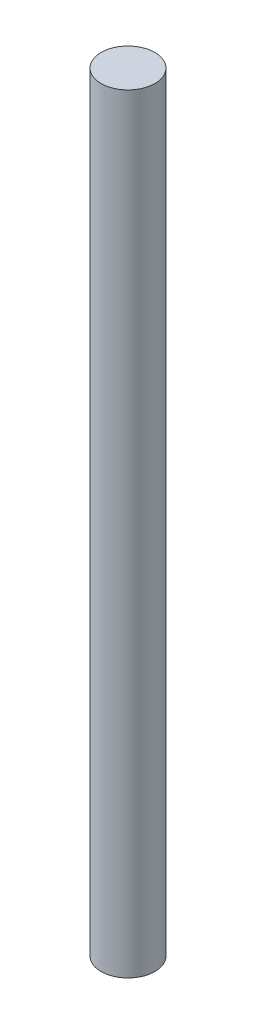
ISO-10303-21;
HEADER;
FILE_DESCRIPTION(('STEP AP214'),'2;1');
FILE_NAME('part.step','',(''),(''),'','','');
FILE_SCHEMA(('AUTOMOTIVE_DESIGN { 1 0 10303 214 1 1 1 1 }'));
ENDSEC;
DATA;
#1=APPLICATION_CONTEXT('core data for automotive mechanical design processes');
#2=APPLICATION_PROTOCOL_DEFINITION('international standard','automotive_design',2000,#1);
#3=PRODUCT_CONTEXT('',#1,'mechanical');
#4=PRODUCT('Part','Part','',(#3));
#5=PRODUCT_RELATED_PRODUCT_CATEGORY('part','',(#4));
#6=PRODUCT_DEFINITION_FORMATION('','',#4);
#7=PRODUCT_DEFINITION_CONTEXT('part definition',#1,'design');
#8=PRODUCT_DEFINITION('design','',#6,#7);
#9=PRODUCT_DEFINITION_SHAPE('','',#8);
#10=(LENGTH_UNIT() NAMED_UNIT(*) SI_UNIT(.MILLI.,.METRE.));
#11=(NAMED_UNIT(*) PLANE_ANGLE_UNIT() SI_UNIT($,.RADIAN.));
#12=(NAMED_UNIT(*) SI_UNIT($,.STERADIAN.) SOLID_ANGLE_UNIT());
#13=UNCERTAINTY_MEASURE_WITH_UNIT(LENGTH_MEASURE(1.E-05),#10,'distance_accuracy_value','');
#14=(GEOMETRIC_REPRESENTATION_CONTEXT(3) GLOBAL_UNCERTAINTY_ASSIGNED_CONTEXT((#13)) GLOBAL_UNIT_ASSIGNED_CONTEXT((#10,
#11,#12)) REPRESENTATION_CONTEXT('',''));
#15=CARTESIAN_POINT('',(0.,0.,0.));
#16=DIRECTION('',(0.,0.,1.));
#17=DIRECTION('',(1.,0.,0.));
#18=AXIS2_PLACEMENT_3D('',#15,#16,#17);
#19=CARTESIAN_POINT('',(0.,114.3,0.));
#20=DIRECTION('',(0.,-1.,0.));
#21=DIRECTION('',(0.,0.,-1.));
#22=AXIS2_PLACEMENT_3D('',#19,#20,#21);
#23=CYLINDRICAL_SURFACE('',#22,4.);
#24=CARTESIAN_POINT('',(0.,114.3,0.));
#25=DIRECTION('',(0.,1.,0.));
#26=DIRECTION('',(0.,0.,1.));
#27=AXIS2_PLACEMENT_3D('',#24,#25,#26);
#28=CIRCLE('',#27,4.);
#29=CARTESIAN_POINT('',(0.,114.3,4.));
#30=VERTEX_POINT('',#29);
#31=EDGE_CURVE('E10',#30,#30,#28,.T.);
#32=ORIENTED_EDGE('',*,*,#31,.F.);
#33=EDGE_LOOP('',(#32));
#34=FACE_BOUND('',#33,.T.);
#35=CARTESIAN_POINT('',(0.,0.,0.));
#36=DIRECTION('',(0.,1.,0.));
#37=DIRECTION('',(0.,0.,1.));
#38=AXIS2_PLACEMENT_3D('',#35,#36,#37);
#39=CIRCLE('',#38,4.);
#40=CARTESIAN_POINT('',(0.,0.,4.));
#41=VERTEX_POINT('',#40);
#42=EDGE_CURVE('E35',#41,#41,#39,.T.);
#43=ORIENTED_EDGE('',*,*,#42,.T.);
#44=EDGE_LOOP('',(#43));
#45=FACE_BOUND('',#44,.T.);
#46=ADVANCED_FACE('F32',(#34,#45),#23,.T.);
#47=CARTESIAN_POINT('',(0.,114.3,0.));
#48=DIRECTION('',(0.,1.,0.));
#49=DIRECTION('',(0.,0.,1.));
#50=AXIS2_PLACEMENT_3D('',#47,#48,#49);
#51=PLANE('',#50);
#52=ORIENTED_EDGE('',*,*,#31,.T.);
#53=EDGE_LOOP('',(#52));
#54=FACE_BOUND('',#53,.T.);
#55=ADVANCED_FACE('F47',(#54),#51,.T.);
#56=CARTESIAN_POINT('',(0.,0.,0.));
#57=DIRECTION('',(0.,1.,0.));
#58=DIRECTION('',(0.,0.,1.));
#59=AXIS2_PLACEMENT_3D('',#56,#57,#58);
#60=PLANE('',#59);
#61=ORIENTED_EDGE('',*,*,#42,.F.);
#62=EDGE_LOOP('',(#61));
#63=FACE_BOUND('',#62,.T.);
#64=ADVANCED_FACE('F45',(#63),#60,.F.);
#65=CLOSED_SHELL('',(#46,#55,#64));
#66=MANIFOLD_SOLID_BREP('B2',#65);
#67=ADVANCED_BREP_SHAPE_REPRESENTATION('',(#18,#66),#14);
#68=SHAPE_DEFINITION_REPRESENTATION(#9,#67);
ENDSEC;
END-ISO-10303-21;
